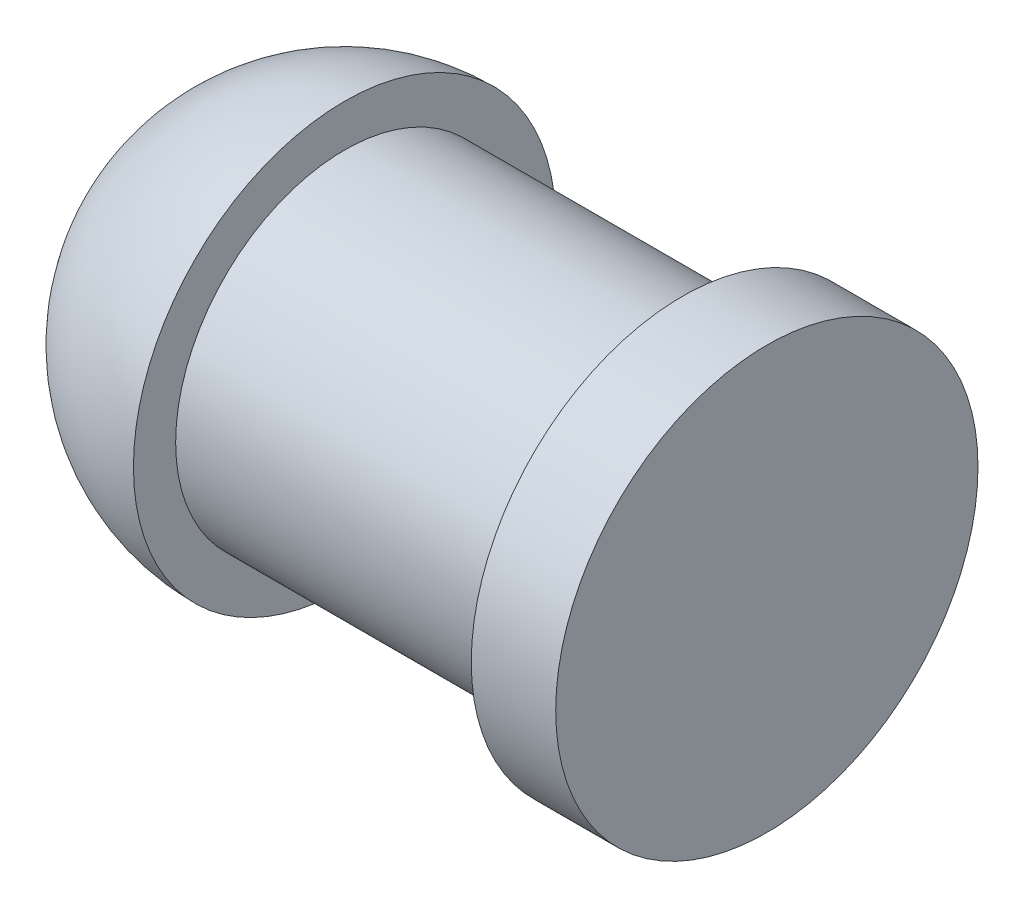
from build123d import *


with BuildPart() as part:
    # Esquisse1 → Base-R_volution (revolve)
    with BuildSketch(Plane.XY, mode=Mode.PRIVATE) as base_r_volution_sk:
        with BuildLine():
            Line((0, 0), (0, 5))
            Line((0, 5), (-2, 5))
            Line((-2, 5), (-2, 4))
            Line((-2, 4), (-10, 4))
            Line((-10, 4), (-10, 5))
            ThreePointArc((-10, 5), (-13.535533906, 3.535533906), (-15, 0))
            Line((-15, 0), (0, 0))
        make_face()
    revolve(base_r_volution_sk.sketch.rotate(Axis((-60, 0, 0), (1, 0, 0)), 90), axis=Axis((-60, 0, 0), (1, 0, 0)))


solid = part.part
